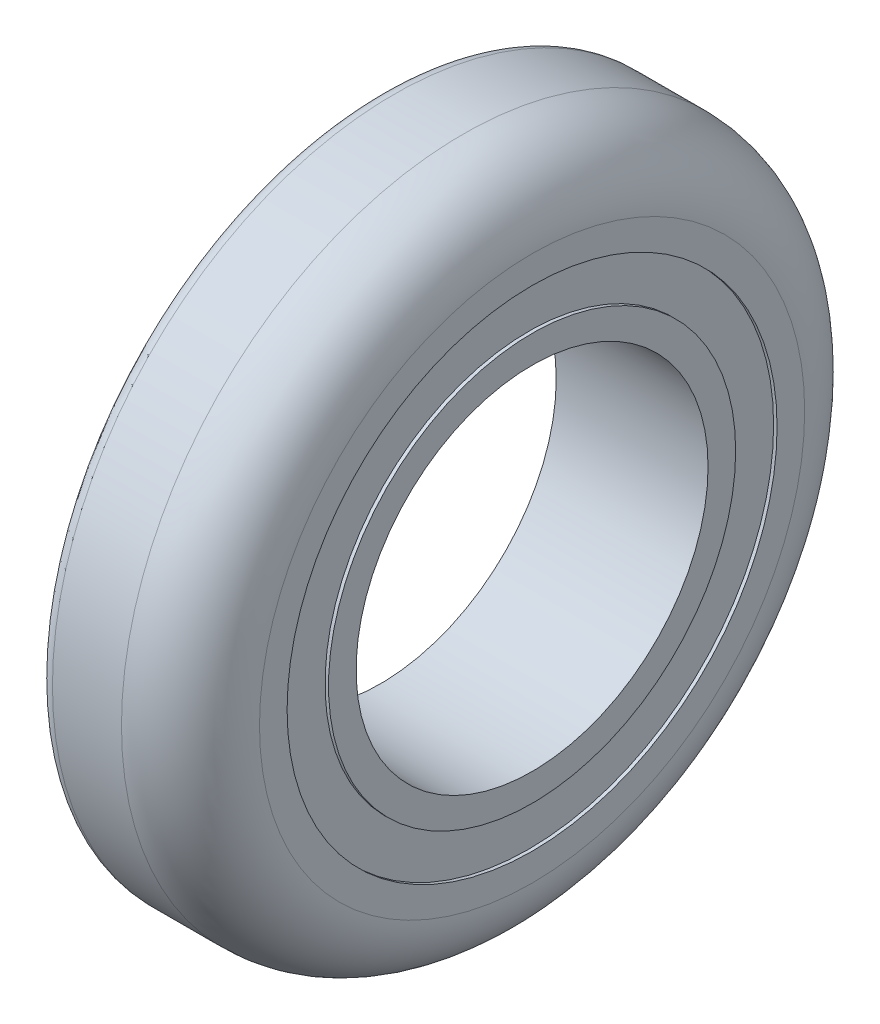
ISO-10303-21;
HEADER;
FILE_DESCRIPTION(('STEP AP214'),'2;1');
FILE_NAME('part.step','',(''),(''),'','','');
FILE_SCHEMA(('AUTOMOTIVE_DESIGN { 1 0 10303 214 1 1 1 1 }'));
ENDSEC;
DATA;
#1=APPLICATION_CONTEXT('core data for automotive mechanical design processes');
#2=APPLICATION_PROTOCOL_DEFINITION('international standard','automotive_design',2000,#1);
#3=PRODUCT_CONTEXT('',#1,'mechanical');
#4=PRODUCT('Part','Part','',(#3));
#5=PRODUCT_RELATED_PRODUCT_CATEGORY('part','',(#4));
#6=PRODUCT_DEFINITION_FORMATION('','',#4);
#7=PRODUCT_DEFINITION_CONTEXT('part definition',#1,'design');
#8=PRODUCT_DEFINITION('design','',#6,#7);
#9=PRODUCT_DEFINITION_SHAPE('','',#8);
#10=(LENGTH_UNIT() NAMED_UNIT(*) SI_UNIT(.MILLI.,.METRE.));
#11=(NAMED_UNIT(*) PLANE_ANGLE_UNIT() SI_UNIT($,.RADIAN.));
#12=(NAMED_UNIT(*) SI_UNIT($,.STERADIAN.) SOLID_ANGLE_UNIT());
#13=UNCERTAINTY_MEASURE_WITH_UNIT(LENGTH_MEASURE(1.E-05),#10,'distance_accuracy_value','');
#14=(GEOMETRIC_REPRESENTATION_CONTEXT(3) GLOBAL_UNCERTAINTY_ASSIGNED_CONTEXT((#13)) GLOBAL_UNIT_ASSIGNED_CONTEXT((#10,
#11,#12)) REPRESENTATION_CONTEXT('',''));
#15=CARTESIAN_POINT('',(0.,0.,0.));
#16=DIRECTION('',(0.,0.,1.));
#17=DIRECTION('',(1.,0.,0.));
#18=AXIS2_PLACEMENT_3D('',#15,#16,#17);
#19=CARTESIAN_POINT('',(0.,0.,0.));
#20=DIRECTION('',(1.,0.,0.));
#21=DIRECTION('',(0.,0.,-1.));
#22=AXIS2_PLACEMENT_3D('',#19,#20,#21);
#23=PLANE('',#22);
#24=CARTESIAN_POINT('',(0.,0.,0.));
#25=DIRECTION('',(1.,0.,0.));
#26=DIRECTION('',(0.,0.,-1.));
#27=AXIS2_PLACEMENT_3D('',#24,#25,#26);
#28=CIRCLE('',#27,25.5);
#29=CARTESIAN_POINT('',(0.,0.,-25.5));
#30=VERTEX_POINT('',#29);
#31=EDGE_CURVE('E54',#30,#30,#28,.T.);
#32=ORIENTED_EDGE('',*,*,#31,.T.);
#33=EDGE_LOOP('',(#32));
#34=FACE_BOUND('',#33,.T.);
#35=CARTESIAN_POINT('',(0.,0.,0.));
#36=DIRECTION('',(-1.,0.,0.));
#37=DIRECTION('',(0.,0.,1.));
#38=AXIS2_PLACEMENT_3D('',#35,#36,#37);
#39=CIRCLE('',#38,29.5);
#40=CARTESIAN_POINT('',(0.,0.,29.5));
#41=VERTEX_POINT('',#40);
#42=EDGE_CURVE('E78',#41,#41,#39,.T.);
#43=ORIENTED_EDGE('',*,*,#42,.T.);
#44=EDGE_LOOP('',(#43));
#45=FACE_BOUND('',#44,.T.);
#46=ADVANCED_FACE('F33',(#34,#45),#23,.F.);
#47=CARTESIAN_POINT('',(22.,0.,0.));
#48=DIRECTION('',(1.,0.,0.));
#49=DIRECTION('',(0.,0.,-1.));
#50=AXIS2_PLACEMENT_3D('',#47,#48,#49);
#51=PLANE('',#50);
#52=CARTESIAN_POINT('',(22.,0.,0.));
#53=DIRECTION('',(1.,0.,0.));
#54=DIRECTION('',(0.,0.,-1.));
#55=AXIS2_PLACEMENT_3D('',#52,#53,#54);
#56=CIRCLE('',#55,25.5);
#57=CARTESIAN_POINT('',(22.,0.,-25.5));
#58=VERTEX_POINT('',#57);
#59=EDGE_CURVE('E53',#58,#58,#56,.T.);
#60=ORIENTED_EDGE('',*,*,#59,.F.);
#61=EDGE_LOOP('',(#60));
#62=FACE_BOUND('',#61,.T.);
#63=CARTESIAN_POINT('',(22.,0.,0.));
#64=DIRECTION('',(1.,0.,0.));
#65=DIRECTION('',(0.,0.,-1.));
#66=AXIS2_PLACEMENT_3D('',#63,#64,#65);
#67=CIRCLE('',#66,29.5);
#68=CARTESIAN_POINT('',(22.,0.,-29.5));
#69=VERTEX_POINT('',#68);
#70=EDGE_CURVE('E66',#69,#69,#67,.T.);
#71=ORIENTED_EDGE('',*,*,#70,.T.);
#72=EDGE_LOOP('',(#71));
#73=FACE_BOUND('',#72,.T.);
#74=ADVANCED_FACE('F111',(#62,#73),#51,.T.);
#75=CARTESIAN_POINT('',(22.,0.,0.));
#76=DIRECTION('',(1.,0.,0.));
#77=DIRECTION('',(0.,0.,-1.));
#78=AXIS2_PLACEMENT_3D('',#75,#76,#77);
#79=CIRCLE('',#78,35.5);
#80=CARTESIAN_POINT('',(22.,0.,-35.5));
#81=VERTEX_POINT('',#80);
#82=EDGE_CURVE('E60',#81,#81,#79,.T.);
#83=ORIENTED_EDGE('',*,*,#82,.F.);
#84=EDGE_LOOP('',(#83));
#85=FACE_BOUND('',#84,.T.);
#86=CARTESIAN_POINT('',(22.,0.,0.));
#87=DIRECTION('',(1.,0.,0.));
#88=DIRECTION('',(0.,0.,-1.));
#89=AXIS2_PLACEMENT_3D('',#86,#87,#88);
#90=CIRCLE('',#89,39.5);
#91=CARTESIAN_POINT('',(22.,0.,-39.5));
#92=VERTEX_POINT('',#91);
#93=EDGE_CURVE('E48',#92,#92,#90,.T.);
#94=ORIENTED_EDGE('',*,*,#93,.T.);
#95=EDGE_LOOP('',(#94));
#96=FACE_BOUND('',#95,.T.);
#97=ADVANCED_FACE('F103',(#85,#96),#51,.T.);
#98=CARTESIAN_POINT('',(0.,0.,0.));
#99=DIRECTION('',(-1.,0.,0.));
#100=DIRECTION('',(0.,0.,1.));
#101=AXIS2_PLACEMENT_3D('',#98,#99,#100);
#102=CIRCLE('',#101,35.5);
#103=CARTESIAN_POINT('',(0.,0.,35.5));
#104=VERTEX_POINT('',#103);
#105=EDGE_CURVE('E72',#104,#104,#102,.T.);
#106=ORIENTED_EDGE('',*,*,#105,.F.);
#107=EDGE_LOOP('',(#106));
#108=FACE_BOUND('',#107,.T.);
#109=CARTESIAN_POINT('',(0.,0.,0.));
#110=DIRECTION('',(1.,0.,0.));
#111=DIRECTION('',(0.,0.,-1.));
#112=AXIS2_PLACEMENT_3D('',#109,#110,#111);
#113=CIRCLE('',#112,47.5);
#114=CARTESIAN_POINT('',(0.,0.,-47.5));
#115=VERTEX_POINT('',#114);
#116=EDGE_CURVE('E10',#115,#115,#113,.F.);
#117=ORIENTED_EDGE('',*,*,#116,.T.);
#118=EDGE_LOOP('',(#117));
#119=FACE_BOUND('',#118,.T.);
#120=ADVANCED_FACE('F100',(#108,#119),#23,.F.);
#121=CARTESIAN_POINT('',(22.,0.,0.));
#122=DIRECTION('',(-1.,0.,0.));
#123=DIRECTION('',(0.,0.,1.));
#124=AXIS2_PLACEMENT_3D('',#121,#122,#123);
#125=CYLINDRICAL_SURFACE('',#124,49.5);
#126=CARTESIAN_POINT('',(2.,0.,0.));
#127=DIRECTION('',(1.,0.,0.));
#128=DIRECTION('',(0.,0.,-1.));
#129=AXIS2_PLACEMENT_3D('',#126,#127,#128);
#130=CIRCLE('',#129,49.5);
#131=CARTESIAN_POINT('',(2.,0.,-49.5));
#132=VERTEX_POINT('',#131);
#133=EDGE_CURVE('E40',#132,#132,#130,.T.);
#134=ORIENTED_EDGE('',*,*,#133,.T.);
#135=EDGE_LOOP('',(#134));
#136=FACE_BOUND('',#135,.T.);
#137=CARTESIAN_POINT('',(12.,0.,0.));
#138=DIRECTION('',(1.,0.,0.));
#139=DIRECTION('',(0.,0.,-1.));
#140=AXIS2_PLACEMENT_3D('',#137,#138,#139);
#141=CIRCLE('',#140,49.5);
#142=CARTESIAN_POINT('',(12.,0.,-49.5));
#143=VERTEX_POINT('',#142);
#144=EDGE_CURVE('E44',#143,#143,#141,.F.);
#145=ORIENTED_EDGE('',*,*,#144,.T.);
#146=EDGE_LOOP('',(#145));
#147=FACE_BOUND('',#146,.T.);
#148=ADVANCED_FACE('F102',(#136,#147),#125,.T.);
#149=CARTESIAN_POINT('',(22.,0.,0.));
#150=DIRECTION('',(-1.,0.,0.));
#151=DIRECTION('',(0.,0.,1.));
#152=AXIS2_PLACEMENT_3D('',#149,#150,#151);
#153=CYLINDRICAL_SURFACE('',#152,25.5);
#154=ORIENTED_EDGE('',*,*,#59,.T.);
#155=EDGE_LOOP('',(#154));
#156=FACE_BOUND('',#155,.T.);
#157=ORIENTED_EDGE('',*,*,#31,.F.);
#158=EDGE_LOOP('',(#157));
#159=FACE_BOUND('',#158,.T.);
#160=ADVANCED_FACE('F109',(#156,#159),#153,.F.);
#161=CARTESIAN_POINT('',(12.,0.,0.));
#162=DIRECTION('',(1.,0.,0.));
#163=DIRECTION('',(0.,0.,-1.));
#164=AXIS2_PLACEMENT_3D('',#161,#162,#163);
#165=TOROIDAL_SURFACE('',#164,39.5,10.);
#166=ORIENTED_EDGE('',*,*,#144,.F.);
#167=EDGE_LOOP('',(#166));
#168=FACE_BOUND('',#167,.T.);
#169=ORIENTED_EDGE('',*,*,#93,.F.);
#170=EDGE_LOOP('',(#169));
#171=FACE_BOUND('',#170,.T.);
#172=ADVANCED_FACE('F140',(#168,#171),#165,.T.);
#173=CARTESIAN_POINT('',(2.,0.,0.));
#174=DIRECTION('',(1.,0.,0.));
#175=DIRECTION('',(0.,0.,-1.));
#176=AXIS2_PLACEMENT_3D('',#173,#174,#175);
#177=TOROIDAL_SURFACE('',#176,47.5,2.);
#178=ORIENTED_EDGE('',*,*,#116,.F.);
#179=EDGE_LOOP('',(#178));
#180=FACE_BOUND('',#179,.T.);
#181=ORIENTED_EDGE('',*,*,#133,.F.);
#182=EDGE_LOOP('',(#181));
#183=FACE_BOUND('',#182,.T.);
#184=ADVANCED_FACE('F35',(#180,#183),#177,.T.);
#185=CARTESIAN_POINT('',(21.5,0.,0.));
#186=DIRECTION('',(1.,0.,0.));
#187=DIRECTION('',(0.,0.,-1.));
#188=AXIS2_PLACEMENT_3D('',#185,#186,#187);
#189=CYLINDRICAL_SURFACE('',#188,35.5);
#190=CARTESIAN_POINT('',(21.5,0.,0.));
#191=DIRECTION('',(1.,0.,0.));
#192=DIRECTION('',(0.,0.,-1.));
#193=AXIS2_PLACEMENT_3D('',#190,#191,#192);
#194=CIRCLE('',#193,35.5);
#195=CARTESIAN_POINT('',(21.5,0.,-35.5));
#196=VERTEX_POINT('',#195);
#197=EDGE_CURVE('E57',#196,#196,#194,.T.);
#198=ORIENTED_EDGE('',*,*,#197,.F.);
#199=EDGE_LOOP('',(#198));
#200=FACE_BOUND('',#199,.T.);
#201=ORIENTED_EDGE('',*,*,#82,.T.);
#202=EDGE_LOOP('',(#201));
#203=FACE_BOUND('',#202,.T.);
#204=ADVANCED_FACE('F134',(#200,#203),#189,.F.);
#205=CARTESIAN_POINT('',(21.5,0.,0.));
#206=DIRECTION('',(1.,0.,0.));
#207=DIRECTION('',(0.,0.,-1.));
#208=AXIS2_PLACEMENT_3D('',#205,#206,#207);
#209=PLANE('',#208);
#210=CARTESIAN_POINT('',(21.5,0.,0.));
#211=DIRECTION('',(1.,0.,0.));
#212=DIRECTION('',(0.,0.,-1.));
#213=AXIS2_PLACEMENT_3D('',#210,#211,#212);
#214=CIRCLE('',#213,29.5);
#215=CARTESIAN_POINT('',(21.5,0.,-29.5));
#216=VERTEX_POINT('',#215);
#217=EDGE_CURVE('E63',#216,#216,#214,.T.);
#218=ORIENTED_EDGE('',*,*,#217,.F.);
#219=EDGE_LOOP('',(#218));
#220=FACE_BOUND('',#219,.T.);
#221=ORIENTED_EDGE('',*,*,#197,.T.);
#222=EDGE_LOOP('',(#221));
#223=FACE_BOUND('',#222,.T.);
#224=ADVANCED_FACE('F130',(#220,#223),#209,.T.);
#225=CARTESIAN_POINT('',(21.5,0.,0.));
#226=DIRECTION('',(1.,0.,0.));
#227=DIRECTION('',(0.,0.,-1.));
#228=AXIS2_PLACEMENT_3D('',#225,#226,#227);
#229=CYLINDRICAL_SURFACE('',#228,29.5);
#230=ORIENTED_EDGE('',*,*,#217,.T.);
#231=EDGE_LOOP('',(#230));
#232=FACE_BOUND('',#231,.T.);
#233=ORIENTED_EDGE('',*,*,#70,.F.);
#234=EDGE_LOOP('',(#233));
#235=FACE_BOUND('',#234,.T.);
#236=ADVANCED_FACE('F96',(#232,#235),#229,.T.);
#237=CARTESIAN_POINT('',(0.5,0.,0.));
#238=DIRECTION('',(-1.,0.,0.));
#239=DIRECTION('',(0.,0.,1.));
#240=AXIS2_PLACEMENT_3D('',#237,#238,#239);
#241=CYLINDRICAL_SURFACE('',#240,35.5);
#242=CARTESIAN_POINT('',(0.5,0.,0.));
#243=DIRECTION('',(-1.,0.,0.));
#244=DIRECTION('',(0.,0.,1.));
#245=AXIS2_PLACEMENT_3D('',#242,#243,#244);
#246=CIRCLE('',#245,35.5);
#247=CARTESIAN_POINT('',(0.5,0.,35.5));
#248=VERTEX_POINT('',#247);
#249=EDGE_CURVE('E69',#248,#248,#246,.T.);
#250=ORIENTED_EDGE('',*,*,#249,.F.);
#251=EDGE_LOOP('',(#250));
#252=FACE_BOUND('',#251,.T.);
#253=ORIENTED_EDGE('',*,*,#105,.T.);
#254=EDGE_LOOP('',(#253));
#255=FACE_BOUND('',#254,.T.);
#256=ADVANCED_FACE('F90',(#252,#255),#241,.F.);
#257=CARTESIAN_POINT('',(0.5,0.,0.));
#258=DIRECTION('',(-1.,0.,0.));
#259=DIRECTION('',(0.,0.,1.));
#260=AXIS2_PLACEMENT_3D('',#257,#258,#259);
#261=PLANE('',#260);
#262=CARTESIAN_POINT('',(0.5,0.,0.));
#263=DIRECTION('',(-1.,0.,0.));
#264=DIRECTION('',(0.,0.,1.));
#265=AXIS2_PLACEMENT_3D('',#262,#263,#264);
#266=CIRCLE('',#265,29.5);
#267=CARTESIAN_POINT('',(0.5,0.,29.5));
#268=VERTEX_POINT('',#267);
#269=EDGE_CURVE('E75',#268,#268,#266,.T.);
#270=ORIENTED_EDGE('',*,*,#269,.F.);
#271=EDGE_LOOP('',(#270));
#272=FACE_BOUND('',#271,.T.);
#273=ORIENTED_EDGE('',*,*,#249,.T.);
#274=EDGE_LOOP('',(#273));
#275=FACE_BOUND('',#274,.T.);
#276=ADVANCED_FACE('F87',(#272,#275),#261,.T.);
#277=CARTESIAN_POINT('',(0.5,0.,0.));
#278=DIRECTION('',(-1.,0.,0.));
#279=DIRECTION('',(0.,0.,1.));
#280=AXIS2_PLACEMENT_3D('',#277,#278,#279);
#281=CYLINDRICAL_SURFACE('',#280,29.5);
#282=ORIENTED_EDGE('',*,*,#269,.T.);
#283=EDGE_LOOP('',(#282));
#284=FACE_BOUND('',#283,.T.);
#285=ORIENTED_EDGE('',*,*,#42,.F.);
#286=EDGE_LOOP('',(#285));
#287=FACE_BOUND('',#286,.T.);
#288=ADVANCED_FACE('F84',(#284,#287),#281,.T.);
#289=CLOSED_SHELL('',(#46,#74,#97,#120,#148,#160,#172,#184,#204,#224,#236,#256,#276,#288));
#290=MANIFOLD_SOLID_BREP('B2',#289);
#291=ADVANCED_BREP_SHAPE_REPRESENTATION('',(#18,#290),#14);
#292=SHAPE_DEFINITION_REPRESENTATION(#9,#291);
ENDSEC;
END-ISO-10303-21;
